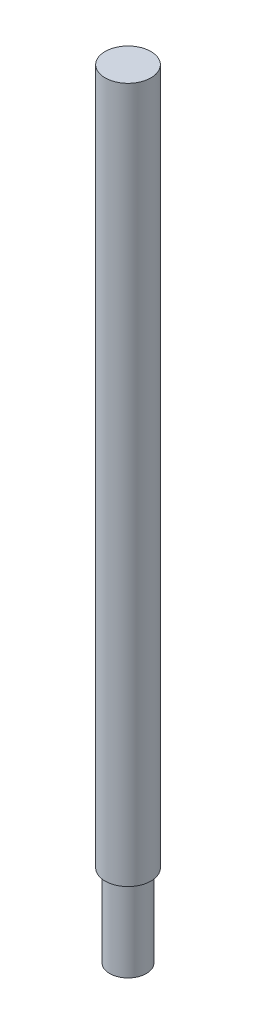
from build123d import *

# Parameters (mm, degrees)
SKETCH_1_R          = 5
EXTRUDE_1_DEPTH     = 170
SKETCH_2_R          = 5
SKETCH_2_R_2        = 4
CUT_EXTRUDE_1_DEPTH = 18


with BuildPart() as part:
    # Sketch 1 → Extrude 1 (new body)
    with BuildSketch(Plane(origin=(0, 0, 0), x_dir=(1, 0, 0), z_dir=(0, 1, 0))):
        with Locations(Location((0, 0, 0), (0, 0, 270))):
            Circle(SKETCH_1_R)
    extrude(amount=EXTRUDE_1_DEPTH)

    # Sketch 2 → Cut-Extrude 1 (cut)
    with BuildSketch(Plane.XZ):
        with Locations(Location((0, 0, 0), (0, 0, 270))):
            Circle(SKETCH_2_R)
        with Locations(Location((0, 0, 0), (0, 0, 270))):
            Circle(SKETCH_2_R_2, mode=Mode.SUBTRACT)
    extrude(amount=-CUT_EXTRUDE_1_DEPTH, mode=Mode.SUBTRACT)


solid = part.part
